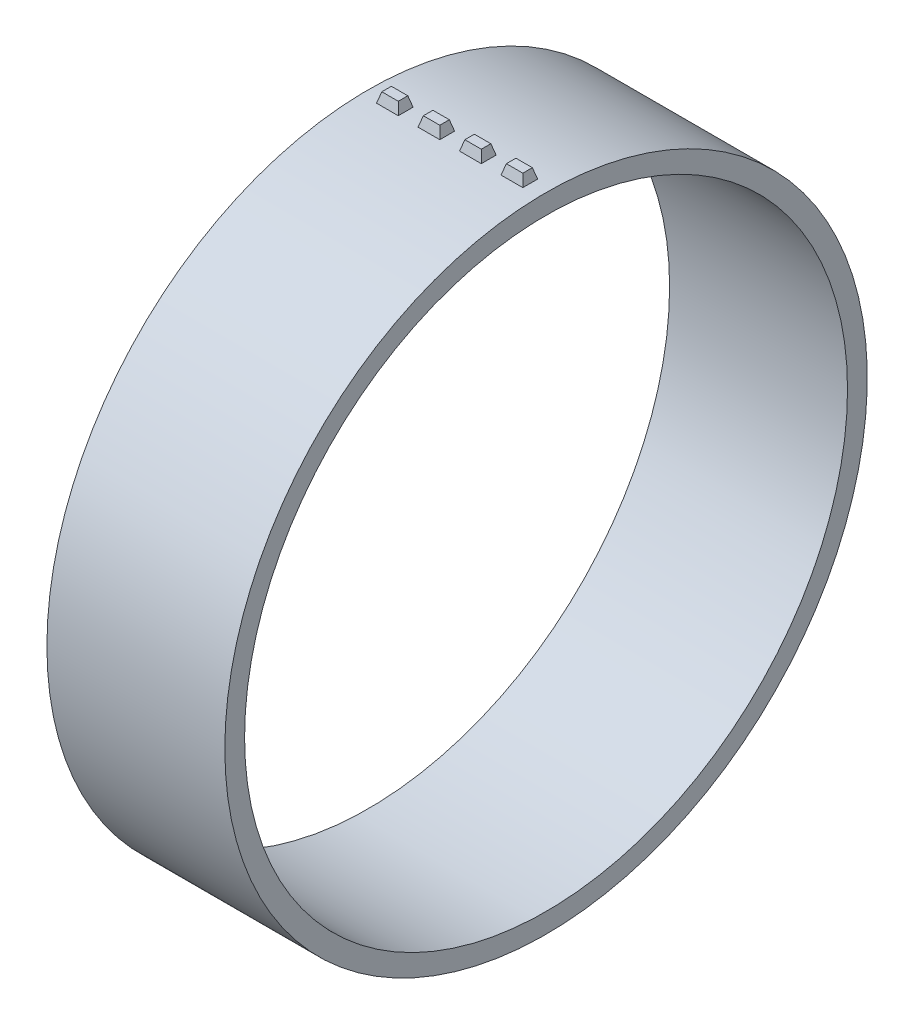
from build123d import *

# Parameters (mm, degrees)
SKIZZE1_W                         = 180
SKIZZE1_H                         = 20
SKIZZE2_W                         = 22
SKIZZE2_H                         = 15
LINEAR_AUSTRAGEN1_DEPTH           = 10
LINEAR_AUSTRAGEN1_DRAFT           = 15
LINEAR_AUSTRAGEN1_PROFILE_2_DEPTH = 10
LINEAR_AUSTRAGEN1_PROFILE_2_DRAFT = 15
LINEAR_AUSTRAGEN1_PROFILE_3_DEPTH = 10
LINEAR_AUSTRAGEN1_PROFILE_3_DRAFT = 15
LINEAR_AUSTRAGEN1_PROFILE_4_DEPTH = 10
LINEAR_AUSTRAGEN1_PROFILE_4_DRAFT = 15


with BuildPart() as part:
    # Skizze1 → Rotation1 (revolve)
    with BuildSketch(Plane.XY, mode=Mode.PRIVATE) as rotation1_sk:
        with Locations((0, 315)):
            Rectangle(SKIZZE1_W, SKIZZE1_H)
    revolve(rotation1_sk.sketch.rotate(Axis((0, 0, 0), (1, 0, 0)), 90), axis=Axis((0, 0, 0), (1, 0, 0)))


with BuildPart() as body_2:
    # Skizze2 → Linear austragen1 (with draft: the straight prism first)
    with BuildSketch(Plane(origin=(0, 325, 0), x_dir=(1, 0, 0), z_dir=(0, 1, 0))):
        with Locations((-63, 0)):
            Rectangle(SKIZZE2_W, SKIZZE2_H)
    extrude(amount=LINEAR_AUSTRAGEN1_DEPTH)
    # Linear austragen1: the draft: its side faces are tilted about the plane it starts from
    linear_austragen1_sides = [body_2.faces().sort_by_distance(p)[0] for p in [
        (-74, 330, 0),
        (-63, 330, 7.5),
        (-52, 330, 0),
        (-63, 330, -7.5),
    ]]
    draft(linear_austragen1_sides, Plane(origin=(0, 325, 0), x_dir=(1, 0, 0), z_dir=(0, 1, 0)), LINEAR_AUSTRAGEN1_DRAFT)


with BuildPart() as body_3:
    # Skizze2 → Linear austragen1 profile 2 (with draft: the straight prism first)
    with BuildSketch(Plane(origin=(0, 325, 0), x_dir=(1, 0, 0), z_dir=(0, 1, 0))):
        with Locations((-21, 0)):
            Rectangle(SKIZZE2_W, SKIZZE2_H)
    extrude(amount=LINEAR_AUSTRAGEN1_PROFILE_2_DEPTH)
    # Linear austragen1 profile 2: the draft: its side faces are tilted about the plane it starts from
    linear_austragen1_profile_2_sides = [body_3.faces().sort_by_distance(p)[0] for p in [
        (-32, 330, 0),
        (-21, 330, 7.5),
        (-10, 330, 0),
        (-21, 330, -7.5),
    ]]
    draft(linear_austragen1_profile_2_sides, Plane(origin=(0, 325, 0), x_dir=(1, 0, 0), z_dir=(0, 1, 0)), LINEAR_AUSTRAGEN1_PROFILE_2_DRAFT)


with BuildPart() as body_4:
    # Skizze2 → Linear austragen1 profile 3 (with draft: the straight prism first)
    with BuildSketch(Plane(origin=(0, 325, 0), x_dir=(1, 0, 0), z_dir=(0, 1, 0))):
        with Locations((21, 0)):
            Rectangle(SKIZZE2_W, SKIZZE2_H)
    extrude(amount=LINEAR_AUSTRAGEN1_PROFILE_3_DEPTH)
    # Linear austragen1 profile 3: the draft: its side faces are tilted about the plane it starts from
    linear_austragen1_profile_3_sides = [body_4.faces().sort_by_distance(p)[0] for p in [
        (10, 330, 0),
        (21, 330, 7.5),
        (32, 330, 0),
        (21, 330, -7.5),
    ]]
    draft(linear_austragen1_profile_3_sides, Plane(origin=(0, 325, 0), x_dir=(1, 0, 0), z_dir=(0, 1, 0)), LINEAR_AUSTRAGEN1_PROFILE_3_DRAFT)


with BuildPart() as body_5:
    # Skizze2 → Linear austragen1 profile 4 (with draft: the straight prism first)
    with BuildSketch(Plane(origin=(0, 325, 0), x_dir=(1, 0, 0), z_dir=(0, 1, 0))):
        with Locations((63, 0)):
            Rectangle(SKIZZE2_W, SKIZZE2_H)
    extrude(amount=LINEAR_AUSTRAGEN1_PROFILE_4_DEPTH)
    # Linear austragen1 profile 4: the draft: its side faces are tilted about the plane it starts from
    linear_austragen1_profile_4_sides = [body_5.faces().sort_by_distance(p)[0] for p in [
        (52, 330, 0),
        (63, 330, 7.5),
        (74, 330, 0),
        (63, 330, -7.5),
    ]]
    draft(linear_austragen1_profile_4_sides, Plane(origin=(0, 325, 0), x_dir=(1, 0, 0), z_dir=(0, 1, 0)), LINEAR_AUSTRAGEN1_PROFILE_4_DRAFT)


solid = Compound([part.part, body_2.part, body_3.part, body_4.part, body_5.part])
